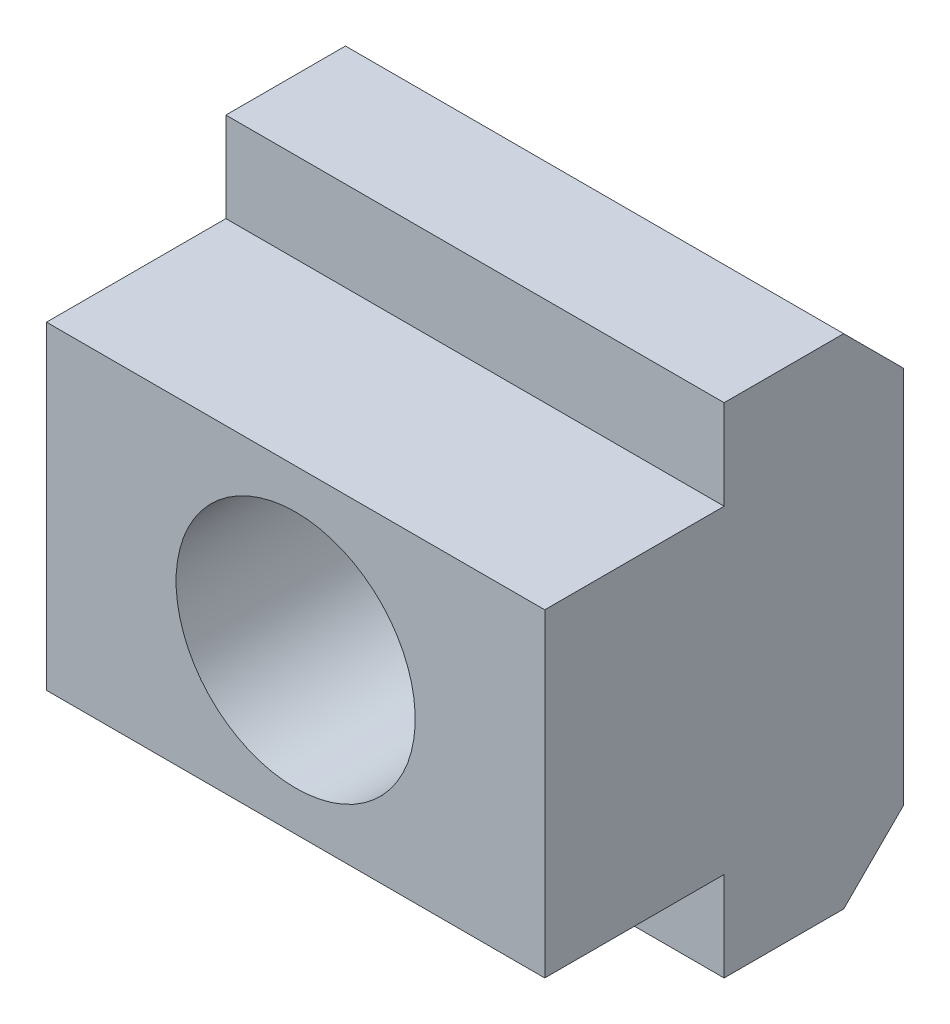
ISO-10303-21;
HEADER;
FILE_DESCRIPTION(('STEP AP214'),'2;1');
FILE_NAME('part.step','',(''),(''),'','','');
FILE_SCHEMA(('AUTOMOTIVE_DESIGN { 1 0 10303 214 1 1 1 1 }'));
ENDSEC;
DATA;
#1=APPLICATION_CONTEXT('core data for automotive mechanical design processes');
#2=APPLICATION_PROTOCOL_DEFINITION('international standard','automotive_design',2000,#1);
#3=PRODUCT_CONTEXT('',#1,'mechanical');
#4=PRODUCT('Part','Part','',(#3));
#5=PRODUCT_RELATED_PRODUCT_CATEGORY('part','',(#4));
#6=PRODUCT_DEFINITION_FORMATION('','',#4);
#7=PRODUCT_DEFINITION_CONTEXT('part definition',#1,'design');
#8=PRODUCT_DEFINITION('design','',#6,#7);
#9=PRODUCT_DEFINITION_SHAPE('','',#8);
#10=(LENGTH_UNIT() NAMED_UNIT(*) SI_UNIT(.MILLI.,.METRE.));
#11=(NAMED_UNIT(*) PLANE_ANGLE_UNIT() SI_UNIT($,.RADIAN.));
#12=(NAMED_UNIT(*) SI_UNIT($,.STERADIAN.) SOLID_ANGLE_UNIT());
#13=UNCERTAINTY_MEASURE_WITH_UNIT(LENGTH_MEASURE(1.E-05),#10,'distance_accuracy_value','');
#14=(GEOMETRIC_REPRESENTATION_CONTEXT(3) GLOBAL_UNCERTAINTY_ASSIGNED_CONTEXT((#13)) GLOBAL_UNIT_ASSIGNED_CONTEXT((#10,
#11,#12)) REPRESENTATION_CONTEXT('',''));
#15=CARTESIAN_POINT('',(0.,0.,0.));
#16=DIRECTION('',(0.,0.,1.));
#17=DIRECTION('',(1.,0.,0.));
#18=AXIS2_PLACEMENT_3D('',#15,#16,#17);
#19=CARTESIAN_POINT('',(-12.5,-8.,9.));
#20=DIRECTION('',(0.,1.,0.));
#21=DIRECTION('',(0.,0.,-1.));
#22=AXIS2_PLACEMENT_3D('',#19,#20,#21);
#23=PLANE('',#22);
#24=DIRECTION('',(0.,0.,1.));
#25=VECTOR('',#24,1.);
#26=CARTESIAN_POINT('',(12.5,-8.,9.));
#27=LINE('',#26,#25);
#28=CARTESIAN_POINT('',(12.5,-8.,0.));
#29=VERTEX_POINT('',#28);
#30=CARTESIAN_POINT('',(12.5,-8.,9.));
#31=VERTEX_POINT('',#30);
#32=EDGE_CURVE('E99',#29,#31,#27,.T.);
#33=ORIENTED_EDGE('',*,*,#32,.T.);
#34=DIRECTION('',(1.,0.,0.));
#35=VECTOR('',#34,1.);
#36=CARTESIAN_POINT('',(-12.5,-8.,9.));
#37=LINE('',#36,#35);
#38=CARTESIAN_POINT('',(-12.5,-8.,9.));
#39=VERTEX_POINT('',#38);
#40=EDGE_CURVE('E107',#39,#31,#37,.T.);
#41=ORIENTED_EDGE('',*,*,#40,.F.);
#42=DIRECTION('',(0.,0.,1.));
#43=VECTOR('',#42,1.);
#44=CARTESIAN_POINT('',(-12.5,-8.,9.));
#45=LINE('',#44,#43);
#46=CARTESIAN_POINT('',(-12.5,-8.,0.));
#47=VERTEX_POINT('',#46);
#48=EDGE_CURVE('E137',#47,#39,#45,.T.);
#49=ORIENTED_EDGE('',*,*,#48,.F.);
#50=DIRECTION('',(1.,0.,0.));
#51=VECTOR('',#50,1.);
#52=CARTESIAN_POINT('',(-12.5,-8.,0.));
#53=LINE('',#52,#51);
#54=EDGE_CURVE('E118',#47,#29,#53,.T.);
#55=ORIENTED_EDGE('',*,*,#54,.T.);
#56=EDGE_LOOP('',(#33,#41,#49,#55));
#57=FACE_BOUND('',#56,.T.);
#58=ADVANCED_FACE('F15',(#57),#23,.F.);
#59=CARTESIAN_POINT('',(-12.5,8.,9.));
#60=DIRECTION('',(0.,0.,-1.));
#61=DIRECTION('',(0.,-1.,0.));
#62=AXIS2_PLACEMENT_3D('',#59,#60,#61);
#63=PLANE('',#62);
#64=CARTESIAN_POINT('',(0.,0.,9.));
#65=DIRECTION('',(0.,0.,1.));
#66=DIRECTION('',(0.,1.,0.));
#67=AXIS2_PLACEMENT_3D('',#64,#65,#66);
#68=CIRCLE('',#67,6.);
#69=CARTESIAN_POINT('',(0.,6.,9.));
#70=VERTEX_POINT('',#69);
#71=EDGE_CURVE('E122',#70,#70,#68,.T.);
#72=ORIENTED_EDGE('',*,*,#71,.F.);
#73=EDGE_LOOP('',(#72));
#74=FACE_BOUND('',#73,.T.);
#75=DIRECTION('',(0.,1.,0.));
#76=VECTOR('',#75,1.);
#77=CARTESIAN_POINT('',(12.5,8.,9.));
#78=LINE('',#77,#76);
#79=CARTESIAN_POINT('',(12.5,8.,9.));
#80=VERTEX_POINT('',#79);
#81=EDGE_CURVE('E93',#31,#80,#78,.T.);
#82=ORIENTED_EDGE('',*,*,#81,.T.);
#83=DIRECTION('',(1.,0.,0.));
#84=VECTOR('',#83,1.);
#85=CARTESIAN_POINT('',(-12.5,8.,9.));
#86=LINE('',#85,#84);
#87=CARTESIAN_POINT('',(-12.5,8.,9.));
#88=VERTEX_POINT('',#87);
#89=EDGE_CURVE('E114',#88,#80,#86,.T.);
#90=ORIENTED_EDGE('',*,*,#89,.F.);
#91=DIRECTION('',(0.,1.,0.));
#92=VECTOR('',#91,1.);
#93=CARTESIAN_POINT('',(-12.5,8.,9.));
#94=LINE('',#93,#92);
#95=EDGE_CURVE('E109',#39,#88,#94,.T.);
#96=ORIENTED_EDGE('',*,*,#95,.F.);
#97=ORIENTED_EDGE('',*,*,#40,.T.);
#98=EDGE_LOOP('',(#82,#90,#96,#97));
#99=FACE_BOUND('',#98,.T.);
#100=ADVANCED_FACE('F108',(#74,#99),#63,.F.);
#101=CARTESIAN_POINT('',(-12.5,8.,9.));
#102=DIRECTION('',(0.,-1.,0.));
#103=DIRECTION('',(1.,0.,0.));
#104=AXIS2_PLACEMENT_3D('',#101,#102,#103);
#105=PLANE('',#104);
#106=DIRECTION('',(0.,0.,-1.));
#107=VECTOR('',#106,1.);
#108=CARTESIAN_POINT('',(12.5,8.,9.));
#109=LINE('',#108,#107);
#110=CARTESIAN_POINT('',(12.5,8.,0.));
#111=VERTEX_POINT('',#110);
#112=EDGE_CURVE('E101',#80,#111,#109,.T.);
#113=ORIENTED_EDGE('',*,*,#112,.T.);
#114=DIRECTION('',(1.,0.,0.));
#115=VECTOR('',#114,1.);
#116=CARTESIAN_POINT('',(-12.5,8.,0.));
#117=LINE('',#116,#115);
#118=CARTESIAN_POINT('',(-12.5,8.,0.));
#119=VERTEX_POINT('',#118);
#120=EDGE_CURVE('E159',#119,#111,#117,.T.);
#121=ORIENTED_EDGE('',*,*,#120,.F.);
#122=DIRECTION('',(0.,0.,-1.));
#123=VECTOR('',#122,1.);
#124=CARTESIAN_POINT('',(-12.5,8.,9.));
#125=LINE('',#124,#123);
#126=EDGE_CURVE('E140',#88,#119,#125,.T.);
#127=ORIENTED_EDGE('',*,*,#126,.F.);
#128=ORIENTED_EDGE('',*,*,#89,.T.);
#129=EDGE_LOOP('',(#113,#121,#127,#128));
#130=FACE_BOUND('',#129,.T.);
#131=ADVANCED_FACE('F200',(#130),#105,.F.);
#132=CARTESIAN_POINT('',(-12.5,8.,0.));
#133=DIRECTION('',(0.,0.,-1.));
#134=DIRECTION('',(0.,-1.,0.));
#135=AXIS2_PLACEMENT_3D('',#132,#133,#134);
#136=PLANE('',#135);
#137=DIRECTION('',(0.,1.,0.));
#138=VECTOR('',#137,1.);
#139=CARTESIAN_POINT('',(12.5,8.,0.));
#140=LINE('',#139,#138);
#141=CARTESIAN_POINT('',(12.5,12.5,0.));
#142=VERTEX_POINT('',#141);
#143=EDGE_CURVE('E127',#111,#142,#140,.T.);
#144=ORIENTED_EDGE('',*,*,#143,.T.);
#145=DIRECTION('',(1.,0.,0.));
#146=VECTOR('',#145,1.);
#147=CARTESIAN_POINT('',(-12.5,12.5,0.));
#148=LINE('',#147,#146);
#149=CARTESIAN_POINT('',(-12.5,12.5,0.));
#150=VERTEX_POINT('',#149);
#151=EDGE_CURVE('E156',#150,#142,#148,.T.);
#152=ORIENTED_EDGE('',*,*,#151,.F.);
#153=DIRECTION('',(0.,1.,0.));
#154=VECTOR('',#153,1.);
#155=CARTESIAN_POINT('',(-12.5,8.,0.));
#156=LINE('',#155,#154);
#157=EDGE_CURVE('E142',#119,#150,#156,.T.);
#158=ORIENTED_EDGE('',*,*,#157,.F.);
#159=ORIENTED_EDGE('',*,*,#120,.T.);
#160=EDGE_LOOP('',(#144,#152,#158,#159));
#161=FACE_BOUND('',#160,.T.);
#162=ADVANCED_FACE('F196',(#161),#136,.F.);
#163=CARTESIAN_POINT('',(-12.5,12.5,0.));
#164=DIRECTION('',(0.,-1.,0.));
#165=DIRECTION('',(0.,0.,1.));
#166=AXIS2_PLACEMENT_3D('',#163,#164,#165);
#167=PLANE('',#166);
#168=DIRECTION('',(0.,0.,-1.));
#169=VECTOR('',#168,1.);
#170=CARTESIAN_POINT('',(12.5,12.5,0.));
#171=LINE('',#170,#169);
#172=CARTESIAN_POINT('',(12.5,12.5,-6.));
#173=VERTEX_POINT('',#172);
#174=EDGE_CURVE('E129',#142,#173,#171,.T.);
#175=ORIENTED_EDGE('',*,*,#174,.T.);
#176=DIRECTION('',(-1.,0.,0.));
#177=VECTOR('',#176,1.);
#178=CARTESIAN_POINT('',(-12.5,12.5,-6.));
#179=LINE('',#178,#177);
#180=CARTESIAN_POINT('',(-12.5,12.5,-6.));
#181=VERTEX_POINT('',#180);
#182=EDGE_CURVE('E9',#173,#181,#179,.T.);
#183=ORIENTED_EDGE('',*,*,#182,.T.);
#184=DIRECTION('',(0.,0.,-1.));
#185=VECTOR('',#184,1.);
#186=CARTESIAN_POINT('',(-12.5,12.5,0.));
#187=LINE('',#186,#185);
#188=EDGE_CURVE('E144',#150,#181,#187,.T.);
#189=ORIENTED_EDGE('',*,*,#188,.F.);
#190=ORIENTED_EDGE('',*,*,#151,.T.);
#191=EDGE_LOOP('',(#175,#183,#189,#190));
#192=FACE_BOUND('',#191,.T.);
#193=ADVANCED_FACE('F192',(#192),#167,.F.);
#194=CARTESIAN_POINT('',(-12.5,12.5,-9.));
#195=DIRECTION('',(0.,0.,1.));
#196=DIRECTION('',(0.,1.,0.));
#197=AXIS2_PLACEMENT_3D('',#194,#195,#196);
#198=PLANE('',#197);
#199=CARTESIAN_POINT('',(0.,0.,-9.));
#200=DIRECTION('',(0.,0.,1.));
#201=DIRECTION('',(0.,1.,0.));
#202=AXIS2_PLACEMENT_3D('',#199,#200,#201);
#203=CIRCLE('',#202,6.);
#204=CARTESIAN_POINT('',(0.,5.99999999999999,-9.));
#205=VERTEX_POINT('',#204);
#206=EDGE_CURVE('E119',#205,#205,#203,.T.);
#207=ORIENTED_EDGE('',*,*,#206,.T.);
#208=EDGE_LOOP('',(#207));
#209=FACE_BOUND('',#208,.T.);
#210=DIRECTION('',(0.,-1.,0.));
#211=VECTOR('',#210,1.);
#212=CARTESIAN_POINT('',(12.5,12.5,-9.));
#213=LINE('',#212,#211);
#214=CARTESIAN_POINT('',(12.5,9.5,-9.));
#215=VERTEX_POINT('',#214);
#216=CARTESIAN_POINT('',(12.5,-9.5,-9.));
#217=VERTEX_POINT('',#216);
#218=EDGE_CURVE('E131',#215,#217,#213,.T.);
#219=ORIENTED_EDGE('',*,*,#218,.T.);
#220=DIRECTION('',(-1.,0.,0.));
#221=VECTOR('',#220,1.);
#222=CARTESIAN_POINT('',(-12.5,-9.5,-9.));
#223=LINE('',#222,#221);
#224=CARTESIAN_POINT('',(-12.5,-9.5,-9.));
#225=VERTEX_POINT('',#224);
#226=EDGE_CURVE('E35',#217,#225,#223,.T.);
#227=ORIENTED_EDGE('',*,*,#226,.T.);
#228=DIRECTION('',(0.,-1.,0.));
#229=VECTOR('',#228,1.);
#230=CARTESIAN_POINT('',(-12.5,12.5,-9.));
#231=LINE('',#230,#229);
#232=CARTESIAN_POINT('',(-12.5,9.5,-9.));
#233=VERTEX_POINT('',#232);
#234=EDGE_CURVE('E146',#233,#225,#231,.T.);
#235=ORIENTED_EDGE('',*,*,#234,.F.);
#236=DIRECTION('',(1.,0.,0.));
#237=VECTOR('',#236,1.);
#238=CARTESIAN_POINT('',(-12.5,9.5,-9.));
#239=LINE('',#238,#237);
#240=EDGE_CURVE('E169',#233,#215,#239,.T.);
#241=ORIENTED_EDGE('',*,*,#240,.T.);
#242=EDGE_LOOP('',(#219,#227,#235,#241));
#243=FACE_BOUND('',#242,.T.);
#244=ADVANCED_FACE('F186',(#209,#243),#198,.F.);
#245=CARTESIAN_POINT('',(-12.5,-12.5,0.));
#246=DIRECTION('',(0.,1.,0.));
#247=DIRECTION('',(0.,0.,-1.));
#248=AXIS2_PLACEMENT_3D('',#245,#246,#247);
#249=PLANE('',#248);
#250=DIRECTION('',(0.,0.,1.));
#251=VECTOR('',#250,1.);
#252=CARTESIAN_POINT('',(-12.5,-12.5,0.));
#253=LINE('',#252,#251);
#254=CARTESIAN_POINT('',(-12.5,-12.5,-6.));
#255=VERTEX_POINT('',#254);
#256=CARTESIAN_POINT('',(-12.5,-12.5,0.));
#257=VERTEX_POINT('',#256);
#258=EDGE_CURVE('E148',#255,#257,#253,.T.);
#259=ORIENTED_EDGE('',*,*,#258,.F.);
#260=DIRECTION('',(1.,0.,0.));
#261=VECTOR('',#260,1.);
#262=CARTESIAN_POINT('',(-12.5,-12.5,-6.));
#263=LINE('',#262,#261);
#264=CARTESIAN_POINT('',(12.5,-12.5,-6.));
#265=VERTEX_POINT('',#264);
#266=EDGE_CURVE('E113',#255,#265,#263,.T.);
#267=ORIENTED_EDGE('',*,*,#266,.T.);
#268=DIRECTION('',(0.,0.,1.));
#269=VECTOR('',#268,1.);
#270=CARTESIAN_POINT('',(12.5,-12.5,0.));
#271=LINE('',#270,#269);
#272=CARTESIAN_POINT('',(12.5,-12.5,0.));
#273=VERTEX_POINT('',#272);
#274=EDGE_CURVE('E133',#265,#273,#271,.T.);
#275=ORIENTED_EDGE('',*,*,#274,.T.);
#276=DIRECTION('',(1.,0.,0.));
#277=VECTOR('',#276,1.);
#278=CARTESIAN_POINT('',(-12.5,-12.5,0.));
#279=LINE('',#278,#277);
#280=EDGE_CURVE('E153',#257,#273,#279,.T.);
#281=ORIENTED_EDGE('',*,*,#280,.F.);
#282=EDGE_LOOP('',(#259,#267,#275,#281));
#283=FACE_BOUND('',#282,.T.);
#284=ADVANCED_FACE('F182',(#283),#249,.F.);
#285=CARTESIAN_POINT('',(-12.5,-8.,0.));
#286=DIRECTION('',(0.,0.,-1.));
#287=DIRECTION('',(0.,-1.,0.));
#288=AXIS2_PLACEMENT_3D('',#285,#286,#287);
#289=PLANE('',#288);
#290=DIRECTION('',(0.,1.,0.));
#291=VECTOR('',#290,1.);
#292=CARTESIAN_POINT('',(12.5,-8.,0.));
#293=LINE('',#292,#291);
#294=EDGE_CURVE('E135',#273,#29,#293,.T.);
#295=ORIENTED_EDGE('',*,*,#294,.T.);
#296=ORIENTED_EDGE('',*,*,#54,.F.);
#297=DIRECTION('',(0.,1.,0.));
#298=VECTOR('',#297,1.);
#299=CARTESIAN_POINT('',(-12.5,-8.,0.));
#300=LINE('',#299,#298);
#301=EDGE_CURVE('E150',#257,#47,#300,.T.);
#302=ORIENTED_EDGE('',*,*,#301,.F.);
#303=ORIENTED_EDGE('',*,*,#280,.T.);
#304=EDGE_LOOP('',(#295,#296,#302,#303));
#305=FACE_BOUND('',#304,.T.);
#306=ADVANCED_FACE('F202',(#305),#289,.F.);
#307=CARTESIAN_POINT('',(-12.5,-8.,9.));
#308=DIRECTION('',(-1.,0.,0.));
#309=DIRECTION('',(0.,-1.,0.));
#310=AXIS2_PLACEMENT_3D('',#307,#308,#309);
#311=PLANE('',#310);
#312=ORIENTED_EDGE('',*,*,#234,.T.);
#313=DIRECTION('',(0.,0.707106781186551,-0.707106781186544));
#314=VECTOR('',#313,1.);
#315=CARTESIAN_POINT('',(-12.5,-17.75,-0.75));
#316=LINE('',#315,#314);
#317=EDGE_CURVE('E22',#225,#255,#316,.F.);
#318=ORIENTED_EDGE('',*,*,#317,.T.);
#319=ORIENTED_EDGE('',*,*,#258,.T.);
#320=ORIENTED_EDGE('',*,*,#301,.T.);
#321=ORIENTED_EDGE('',*,*,#48,.T.);
#322=ORIENTED_EDGE('',*,*,#95,.T.);
#323=ORIENTED_EDGE('',*,*,#126,.T.);
#324=ORIENTED_EDGE('',*,*,#157,.T.);
#325=ORIENTED_EDGE('',*,*,#188,.T.);
#326=DIRECTION('',(0.,0.707106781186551,0.707106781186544));
#327=VECTOR('',#326,1.);
#328=CARTESIAN_POINT('',(-12.5,9.74999999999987,-8.75));
#329=LINE('',#328,#327);
#330=EDGE_CURVE('E173',#181,#233,#329,.F.);
#331=ORIENTED_EDGE('',*,*,#330,.T.);
#332=EDGE_LOOP('',(#312,#318,#319,#320,#321,#322,#323,#324,#325,#331));
#333=FACE_BOUND('',#332,.T.);
#334=ADVANCED_FACE('F177',(#333),#311,.T.);
#335=CARTESIAN_POINT('',(12.5,-8.,9.));
#336=DIRECTION('',(-1.,0.,0.));
#337=DIRECTION('',(0.,-1.,0.));
#338=AXIS2_PLACEMENT_3D('',#335,#336,#337);
#339=PLANE('',#338);
#340=ORIENTED_EDGE('',*,*,#274,.F.);
#341=DIRECTION('',(0.,-0.707106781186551,0.707106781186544));
#342=VECTOR('',#341,1.);
#343=CARTESIAN_POINT('',(12.5,-12.5,-6.));
#344=LINE('',#343,#342);
#345=EDGE_CURVE('E167',#265,#217,#344,.F.);
#346=ORIENTED_EDGE('',*,*,#345,.T.);
#347=ORIENTED_EDGE('',*,*,#218,.F.);
#348=DIRECTION('',(0.,-0.707106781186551,-0.707106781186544));
#349=VECTOR('',#348,1.);
#350=CARTESIAN_POINT('',(12.5,9.5,-9.));
#351=LINE('',#350,#349);
#352=EDGE_CURVE('E165',#215,#173,#351,.F.);
#353=ORIENTED_EDGE('',*,*,#352,.T.);
#354=ORIENTED_EDGE('',*,*,#174,.F.);
#355=ORIENTED_EDGE('',*,*,#143,.F.);
#356=ORIENTED_EDGE('',*,*,#112,.F.);
#357=ORIENTED_EDGE('',*,*,#81,.F.);
#358=ORIENTED_EDGE('',*,*,#32,.F.);
#359=ORIENTED_EDGE('',*,*,#294,.F.);
#360=EDGE_LOOP('',(#340,#346,#347,#353,#354,#355,#356,#357,#358,#359));
#361=FACE_BOUND('',#360,.T.);
#362=ADVANCED_FACE('F96',(#361),#339,.F.);
#363=CARTESIAN_POINT('',(-12.5,-12.5,-6.));
#364=DIRECTION('',(0.,0.707106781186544,0.707106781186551));
#365=DIRECTION('',(0.,0.707106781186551,-0.707106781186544));
#366=AXIS2_PLACEMENT_3D('',#363,#364,#365);
#367=PLANE('',#366);
#368=ORIENTED_EDGE('',*,*,#317,.F.);
#369=ORIENTED_EDGE('',*,*,#226,.F.);
#370=ORIENTED_EDGE('',*,*,#345,.F.);
#371=ORIENTED_EDGE('',*,*,#266,.F.);
#372=EDGE_LOOP('',(#368,#369,#370,#371));
#373=FACE_BOUND('',#372,.T.);
#374=ADVANCED_FACE('F184',(#373),#367,.F.);
#375=CARTESIAN_POINT('',(-12.5,9.5,-9.));
#376=DIRECTION('',(0.,-0.707106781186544,0.707106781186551));
#377=DIRECTION('',(0.,0.707106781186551,0.707106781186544));
#378=AXIS2_PLACEMENT_3D('',#375,#376,#377);
#379=PLANE('',#378);
#380=ORIENTED_EDGE('',*,*,#330,.F.);
#381=ORIENTED_EDGE('',*,*,#182,.F.);
#382=ORIENTED_EDGE('',*,*,#352,.F.);
#383=ORIENTED_EDGE('',*,*,#240,.F.);
#384=EDGE_LOOP('',(#380,#381,#382,#383));
#385=FACE_BOUND('',#384,.T.);
#386=ADVANCED_FACE('F190',(#385),#379,.F.);
#387=CARTESIAN_POINT('',(0.,0.,-9.));
#388=DIRECTION('',(0.,0.,1.));
#389=DIRECTION('',(0.,1.,0.));
#390=AXIS2_PLACEMENT_3D('',#387,#388,#389);
#391=CYLINDRICAL_SURFACE('',#390,6.);
#392=ORIENTED_EDGE('',*,*,#206,.F.);
#393=EDGE_LOOP('',(#392));
#394=FACE_BOUND('',#393,.T.);
#395=ORIENTED_EDGE('',*,*,#71,.T.);
#396=EDGE_LOOP('',(#395));
#397=FACE_BOUND('',#396,.T.);
#398=ADVANCED_FACE('F237',(#394,#397),#391,.F.);
#399=CLOSED_SHELL('',(#58,#100,#131,#162,#193,#244,#284,#306,#334,#362,#374,#386,#398));
#400=MANIFOLD_SOLID_BREP('B1',#399);
#401=ADVANCED_BREP_SHAPE_REPRESENTATION('',(#18,#400),#14);
#402=SHAPE_DEFINITION_REPRESENTATION(#9,#401);
ENDSEC;
END-ISO-10303-21;
